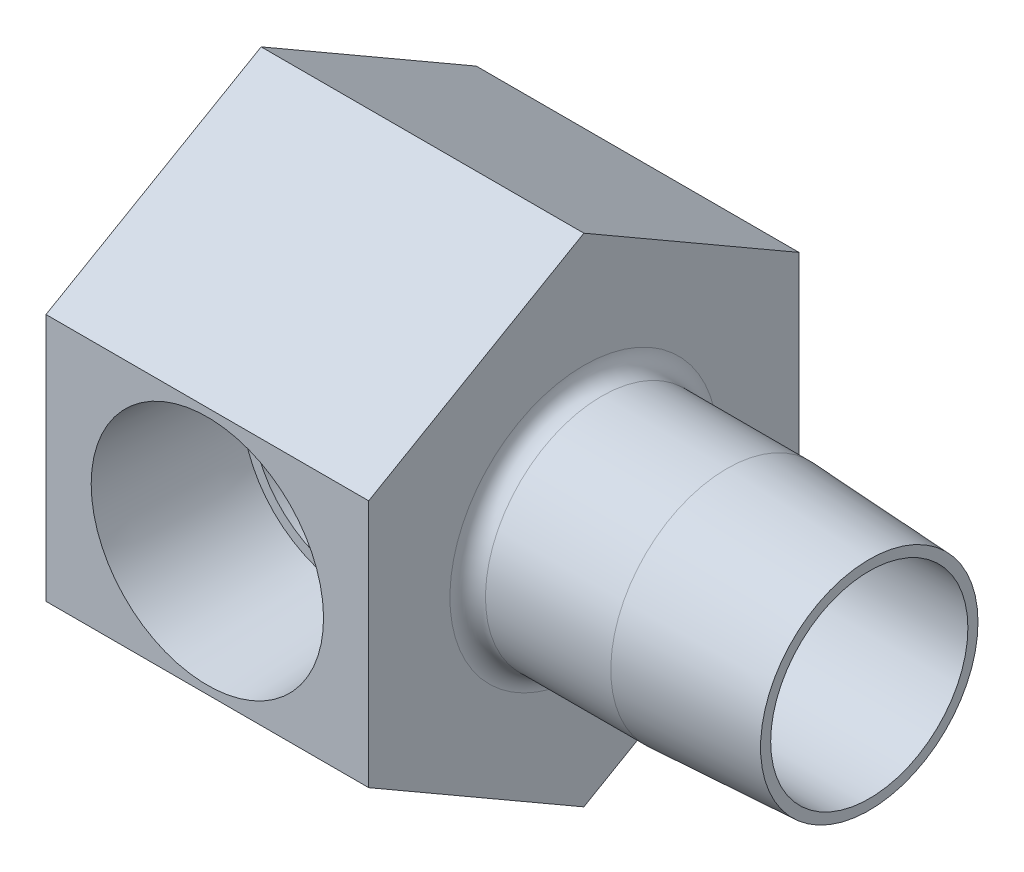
ISO-10303-21;
HEADER;
FILE_DESCRIPTION(('STEP AP214'),'2;1');
FILE_NAME('part.step','',(''),(''),'','','');
FILE_SCHEMA(('AUTOMOTIVE_DESIGN { 1 0 10303 214 1 1 1 1 }'));
ENDSEC;
DATA;
#1=APPLICATION_CONTEXT('core data for automotive mechanical design processes');
#2=APPLICATION_PROTOCOL_DEFINITION('international standard','automotive_design',2000,#1);
#3=PRODUCT_CONTEXT('',#1,'mechanical');
#4=PRODUCT('Part','Part','',(#3));
#5=PRODUCT_RELATED_PRODUCT_CATEGORY('part','',(#4));
#6=PRODUCT_DEFINITION_FORMATION('','',#4);
#7=PRODUCT_DEFINITION_CONTEXT('part definition',#1,'design');
#8=PRODUCT_DEFINITION('design','',#6,#7);
#9=PRODUCT_DEFINITION_SHAPE('','',#8);
#10=(LENGTH_UNIT() NAMED_UNIT(*) SI_UNIT(.MILLI.,.METRE.));
#11=(NAMED_UNIT(*) PLANE_ANGLE_UNIT() SI_UNIT($,.RADIAN.));
#12=(NAMED_UNIT(*) SI_UNIT($,.STERADIAN.) SOLID_ANGLE_UNIT());
#13=UNCERTAINTY_MEASURE_WITH_UNIT(LENGTH_MEASURE(1.E-05),#10,'distance_accuracy_value','');
#14=(GEOMETRIC_REPRESENTATION_CONTEXT(3) GLOBAL_UNCERTAINTY_ASSIGNED_CONTEXT((#13)) GLOBAL_UNIT_ASSIGNED_CONTEXT((#10,
#11,#12)) REPRESENTATION_CONTEXT('',''));
#15=CARTESIAN_POINT('',(0.,0.,0.));
#16=DIRECTION('',(0.,0.,1.));
#17=DIRECTION('',(1.,0.,0.));
#18=AXIS2_PLACEMENT_3D('',#15,#16,#17);
#19=CARTESIAN_POINT('',(6.30059133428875,0.,-4.81071060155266));
#20=DIRECTION('',(-1.,0.,0.));
#21=DIRECTION('',(0.,0.,1.));
#22=AXIS2_PLACEMENT_3D('',#19,#20,#21);
#23=PLANE('',#22);
#24=CARTESIAN_POINT('',(6.30059133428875,0.,0.));
#25=DIRECTION('',(-1.,0.,0.));
#26=DIRECTION('',(0.,0.,1.));
#27=AXIS2_PLACEMENT_3D('',#24,#25,#26);
#28=CIRCLE('',#27,4.365625);
#29=CARTESIAN_POINT('',(6.30059133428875,0.,4.365625));
#30=VERTEX_POINT('',#29);
#31=EDGE_CURVE('E17',#30,#30,#28,.F.);
#32=ORIENTED_EDGE('',*,*,#31,.F.);
#33=EDGE_LOOP('',(#32));
#34=FACE_BOUND('',#33,.T.);
#35=CARTESIAN_POINT('',(6.30059133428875,0.,0.));
#36=DIRECTION('',(1.,0.,0.));
#37=DIRECTION('',(0.,0.,-1.));
#38=AXIS2_PLACEMENT_3D('',#35,#36,#37);
#39=CIRCLE('',#38,4.8133);
#40=CARTESIAN_POINT('',(6.30059133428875,0.,-4.8133));
#41=VERTEX_POINT('',#40);
#42=EDGE_CURVE('E132',#41,#41,#39,.T.);
#43=ORIENTED_EDGE('',*,*,#42,.T.);
#44=EDGE_LOOP('',(#43));
#45=FACE_BOUND('',#44,.T.);
#46=ADVANCED_FACE('F14',(#34,#45),#23,.F.);
#47=CARTESIAN_POINT('',(47.3879923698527,0.,0.));
#48=DIRECTION('',(-1.,0.,0.));
#49=DIRECTION('',(0.,0.,1.));
#50=AXIS2_PLACEMENT_3D('',#47,#48,#49);
#51=CYLINDRICAL_SURFACE('',#50,5.1435);
#52=CARTESIAN_POINT('',(0.,0.,0.));
#53=DIRECTION('',(1.,0.,0.));
#54=DIRECTION('',(0.,0.,-1.));
#55=AXIS2_PLACEMENT_3D('',#52,#53,#54);
#56=CIRCLE('',#55,5.1435);
#57=CARTESIAN_POINT('',(0.,0.,-5.1435));
#58=VERTEX_POINT('',#57);
#59=EDGE_CURVE('E135',#58,#58,#56,.T.);
#60=ORIENTED_EDGE('',*,*,#59,.F.);
#61=EDGE_LOOP('',(#60));
#62=FACE_BOUND('',#61,.T.);
#63=CARTESIAN_POINT('',(-5.54850866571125,0.,0.));
#64=DIRECTION('',(1.,0.,0.));
#65=DIRECTION('',(0.,1.,0.));
#66=AXIS2_PLACEMENT_3D('',#63,#64,#65);
#67=CIRCLE('',#66,5.1435);
#68=CARTESIAN_POINT('',(-5.54850866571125,5.1435,0.));
#69=VERTEX_POINT('',#68);
#70=EDGE_CURVE('E9',#69,#69,#67,.T.);
#71=ORIENTED_EDGE('',*,*,#70,.T.);
#72=EDGE_LOOP('',(#71));
#73=FACE_BOUND('',#72,.T.);
#74=ADVANCED_FACE('F141',(#62,#73),#51,.T.);
#75=CARTESIAN_POINT('',(-13.4796586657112,0.,9.525));
#76=DIRECTION('',(0.,0.,1.));
#77=DIRECTION('',(1.,0.,0.));
#78=AXIS2_PLACEMENT_3D('',#75,#76,#77);
#79=CONICAL_SURFACE('',#78,5.1435,0.0523598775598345);
#80=CARTESIAN_POINT('',(-13.4796586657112,0.,9.525));
#81=DIRECTION('',(0.,0.,-1.));
#82=DIRECTION('',(-1.,0.,0.));
#83=AXIS2_PLACEMENT_3D('',#80,#81,#82);
#84=CIRCLE('',#83,5.1435);
#85=CARTESIAN_POINT('',(-18.6231586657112,0.,9.525));
#86=VERTEX_POINT('',#85);
#87=EDGE_CURVE('E464',#86,#86,#84,.T.);
#88=ORIENTED_EDGE('',*,*,#87,.F.);
#89=EDGE_LOOP('',(#88));
#90=FACE_BOUND('',#89,.T.);
#91=CARTESIAN_POINT('',(-13.4796586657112,0.,3.17500000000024));
#92=DIRECTION('',(0.,0.,-1.));
#93=DIRECTION('',(-1.,0.,0.));
#94=AXIS2_PLACEMENT_3D('',#91,#92,#93);
#95=CIRCLE('',#94,4.81071060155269);
#96=CARTESIAN_POINT('',(-9.7160327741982,-2.99634054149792,3.17500000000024));
#97=VERTEX_POINT('',#96);
#98=CARTESIAN_POINT('',(-9.7160327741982,2.99634054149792,3.17500000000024));
#99=VERTEX_POINT('',#98);
#100=EDGE_CURVE('E459',#97,#99,#95,.T.);
#101=ORIENTED_EDGE('',*,*,#100,.T.);
#102=CARTESIAN_POINT('',(-9.7162148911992,2.99655245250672,3.17480000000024));
#103=CARTESIAN_POINT('',(-9.65177316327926,2.92155827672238,3.24556398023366));
#104=CARTESIAN_POINT('',(-9.58883021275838,2.84341410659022,3.31431393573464));
#105=CARTESIAN_POINT('',(-9.46650127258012,2.68056902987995,3.44736758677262));
#106=CARTESIAN_POINT('',(-9.40712057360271,2.59585877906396,3.5116646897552));
#107=CARTESIAN_POINT('',(-9.23463551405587,2.33059710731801,3.69781411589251));
#108=CARTESIAN_POINT('',(-9.12811309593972,2.13996459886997,3.81191441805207));
#109=CARTESIAN_POINT('',(-8.95638480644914,1.76978922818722,3.99514671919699));
#110=CARTESIAN_POINT('',(-8.88720047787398,1.59429861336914,4.06866685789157));
#111=CARTESIAN_POINT('',(-8.79902482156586,1.32069459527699,4.16217936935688));
#112=CARTESIAN_POINT('',(-8.77225288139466,1.22786736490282,4.19053473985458));
#113=CARTESIAN_POINT('',(-8.72432097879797,1.0391950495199,4.24125952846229));
#114=CARTESIAN_POINT('',(-8.70315862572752,0.943351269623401,4.26363149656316));
#115=CARTESIAN_POINT('',(-8.6667096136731,0.748466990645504,4.30214215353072));
#116=CARTESIAN_POINT('',(-8.6514728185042,0.649406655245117,4.3182279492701));
#117=CARTESIAN_POINT('',(-8.62746138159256,0.449682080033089,4.34356923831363));
#118=CARTESIAN_POINT('',(-8.61868373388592,0.349018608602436,4.35282790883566));
#119=CARTESIAN_POINT('',(-8.6077795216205,0.146869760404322,4.36432881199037));
#120=CARTESIAN_POINT('',(-8.605656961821,0.0453839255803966,4.36656681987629));
#121=CARTESIAN_POINT('',(-8.60812463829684,-0.157407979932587,4.36396450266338));
#122=CARTESIAN_POINT('',(-8.61271429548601,-0.258714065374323,4.35912478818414));
#123=CARTESIAN_POINT('',(-8.62762208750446,-0.449057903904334,4.3433984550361));
#124=CARTESIAN_POINT('',(-8.63724926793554,-0.538211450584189,4.33324113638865));
#125=CARTESIAN_POINT('',(-8.66154466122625,-0.715062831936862,4.30759390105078));
#126=CARTESIAN_POINT('',(-8.67621453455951,-0.802760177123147,4.29210222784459));
#127=CARTESIAN_POINT('',(-8.72741978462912,-1.06271154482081,4.23799011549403));
#128=CARTESIAN_POINT('',(-8.77116897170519,-1.23204639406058,4.19171347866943));
#129=CARTESIAN_POINT('',(-8.87758623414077,-1.56656708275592,4.0788703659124));
#130=CARTESIAN_POINT('',(-8.94101646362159,-1.73122409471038,4.01148520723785));
#131=CARTESIAN_POINT('',(-9.08275153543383,-2.04618319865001,3.86035833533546));
#132=CARTESIAN_POINT('',(-9.16107690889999,-2.19646504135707,3.77659404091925));
#133=CARTESIAN_POINT('',(-9.31664062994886,-2.45998630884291,3.60939417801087));
#134=CARTESIAN_POINT('',(-9.39226045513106,-2.57539375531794,3.52781530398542));
#135=CARTESIAN_POINT('',(-9.54984469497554,-2.79452635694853,3.35685501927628));
#136=CARTESIAN_POINT('',(-9.63177855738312,-2.89830245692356,3.26751094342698));
#137=CARTESIAN_POINT('',(-9.7162148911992,-2.99655245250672,3.17480000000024));
#138=B_SPLINE_CURVE_WITH_KNOTS('',3,(#102,#103,#104,#105,#106,#107,#108,#109,#110,#111,#112,
#113,#114,#115,#116,#117,#118,#119,#120,#121,#122,#123,#124,#125,#126,#127,#128,#129,#130,#131,
#132,#133,#134,#135,#136,#137),.UNSPECIFIED.,.F.,.F.,(4,2,2,2,2,2,2,2,2,2,2,2,2,2,2,2,2,4),(0.,
0.364634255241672,0.729797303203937,1.46525067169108,2.06997219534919,2.37170467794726,
2.67330836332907,2.97739780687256,3.28134564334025,3.58547634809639,3.88958081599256,
4.15999530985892,4.43049893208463,4.97084503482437,5.53548493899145,6.10090884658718,
6.58103480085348,7.05896806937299),.UNSPECIFIED.);
#139=EDGE_CURVE('E121',#99,#97,#138,.T.);
#140=ORIENTED_EDGE('',*,*,#139,.T.);
#141=EDGE_LOOP('',(#101,#140));
#142=FACE_BOUND('',#141,.T.);
#143=ADVANCED_FACE('F144',(#90,#142),#79,.F.);
#144=CARTESIAN_POINT('',(-8.66894806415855,0.,3.17500000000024));
#145=DIRECTION('',(0.,0.,1.));
#146=DIRECTION('',(1.,0.,0.));
#147=AXIS2_PLACEMENT_3D('',#144,#145,#146);
#148=PLANE('',#147);
#149=ORIENTED_EDGE('',*,*,#100,.F.);
#150=DIRECTION('',(1.,0.,0.));
#151=VECTOR('',#150,1.);
#152=CARTESIAN_POINT('',(45.5141000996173,-2.99634054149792,3.17500000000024));
#153=LINE('',#152,#151);
#154=CARTESIAN_POINT('',(-10.3046586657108,-2.99634054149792,3.17500000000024));
#155=VERTEX_POINT('',#154);
#156=EDGE_CURVE('E118',#97,#155,#153,.F.);
#157=ORIENTED_EDGE('',*,*,#156,.T.);
#158=CARTESIAN_POINT('',(-13.4796586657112,0.,3.17500000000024));
#159=DIRECTION('',(0.,0.,-1.));
#160=DIRECTION('',(-1.,0.,0.));
#161=AXIS2_PLACEMENT_3D('',#158,#159,#160);
#162=CIRCLE('',#161,4.36562500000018);
#163=CARTESIAN_POINT('',(-10.3046586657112,2.99634054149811,3.17500000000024));
#164=VERTEX_POINT('',#163);
#165=EDGE_CURVE('E117',#155,#164,#162,.T.);
#166=ORIENTED_EDGE('',*,*,#165,.T.);
#167=DIRECTION('',(1.,0.,0.));
#168=VECTOR('',#167,1.);
#169=CARTESIAN_POINT('',(45.5141000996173,2.99634054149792,3.17500000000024));
#170=LINE('',#169,#168);
#171=EDGE_CURVE('E124',#164,#99,#170,.T.);
#172=ORIENTED_EDGE('',*,*,#171,.T.);
#173=EDGE_LOOP('',(#149,#157,#166,#172));
#174=FACE_BOUND('',#173,.T.);
#175=ADVANCED_FACE('F191',(#174),#148,.T.);
#176=CARTESIAN_POINT('',(-13.4796586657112,0.,26.3809426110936));
#177=DIRECTION('',(0.,0.,-1.));
#178=DIRECTION('',(-1.,0.,0.));
#179=AXIS2_PLACEMENT_3D('',#176,#177,#178);
#180=CYLINDRICAL_SURFACE('',#179,4.36562500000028);
#181=ORIENTED_EDGE('',*,*,#165,.F.);
#182=CARTESIAN_POINT('',(-13.4796586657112,0.,0.));
#183=DIRECTION('',(0.707106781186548,0.,-0.707106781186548));
#184=DIRECTION('',(-0.707106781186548,0.,-0.707106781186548));
#185=AXIS2_PLACEMENT_3D('',#182,#183,#184);
#186=ELLIPSE('',#185,6.17392608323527,4.36562500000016);
#187=CARTESIAN_POINT('',(-13.4796586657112,-4.3656250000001,0.));
#188=VERTEX_POINT('',#187);
#189=EDGE_CURVE('E103',#155,#188,#186,.T.);
#190=ORIENTED_EDGE('',*,*,#189,.T.);
#191=CARTESIAN_POINT('',(-13.4796586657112,0.,0.));
#192=DIRECTION('',(-0.707106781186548,0.,-0.707106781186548));
#193=DIRECTION('',(0.707106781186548,0.,-0.707106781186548));
#194=AXIS2_PLACEMENT_3D('',#191,#192,#193);
#195=ELLIPSE('',#194,6.17392608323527,4.36562500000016);
#196=CARTESIAN_POINT('',(-11.6345284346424,-3.95653586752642,-1.84513023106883));
#197=VERTEX_POINT('',#196);
#198=EDGE_CURVE('E99',#188,#197,#195,.F.);
#199=ORIENTED_EDGE('',*,*,#198,.T.);
#200=CARTESIAN_POINT('',(-13.4796586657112,0.,-1.84513023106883));
#201=DIRECTION('',(0.,0.,-1.));
#202=DIRECTION('',(-1.,0.,0.));
#203=AXIS2_PLACEMENT_3D('',#200,#201,#202);
#204=CIRCLE('',#203,4.36562500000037);
#205=CARTESIAN_POINT('',(-11.6345284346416,3.95653586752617,-1.84513023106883));
#206=VERTEX_POINT('',#205);
#207=EDGE_CURVE('E111',#197,#206,#204,.T.);
#208=ORIENTED_EDGE('',*,*,#207,.T.);
#209=CARTESIAN_POINT('',(-13.4796586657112,4.3656250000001,0.));
#210=VERTEX_POINT('',#209);
#211=EDGE_CURVE('E29',#206,#210,#195,.F.);
#212=ORIENTED_EDGE('',*,*,#211,.T.);
#213=EDGE_CURVE('E120',#210,#164,#186,.T.);
#214=ORIENTED_EDGE('',*,*,#213,.T.);
#215=EDGE_LOOP('',(#181,#190,#199,#208,#212,#214));
#216=FACE_BOUND('',#215,.T.);
#217=ADVANCED_FACE('F114',(#216),#180,.F.);
#218=CARTESIAN_POINT('',(-13.4796586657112,0.,-1.84513023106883));
#219=DIRECTION('',(0.,0.,1.));
#220=DIRECTION('',(1.,0.,0.));
#221=AXIS2_PLACEMENT_3D('',#218,#219,#220);
#222=CONICAL_SURFACE('',#221,4.36562500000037,1.0471975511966);
#223=ORIENTED_EDGE('',*,*,#207,.F.);
#224=CARTESIAN_POINT('',(-11.633908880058,-3.95662913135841,-1.84493023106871));
#225=CARTESIAN_POINT('',(-11.7084330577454,-3.94541760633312,-1.8689810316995));
#226=CARTESIAN_POINT('',(-11.7832061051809,-3.93428272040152,-1.89228060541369));
#227=CARTESIAN_POINT('',(-11.9333902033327,-3.91242782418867,-1.93706139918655));
#228=CARTESIAN_POINT('',(-12.0088015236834,-3.90170800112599,-1.95854180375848));
#229=CARTESIAN_POINT('',(-12.234923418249,-3.87074056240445,-2.01943082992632));
#230=CARTESIAN_POINT('',(-12.3866798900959,-3.8515020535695,-2.05567192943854));
#231=CARTESIAN_POINT('',(-12.6167297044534,-3.82676825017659,-2.10115040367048));
#232=CARTESIAN_POINT('',(-12.6939224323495,-3.81920348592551,-2.11484194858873));
#233=CARTESIAN_POINT('',(-12.8489890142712,-3.80585437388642,-2.13877054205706));
#234=CARTESIAN_POINT('',(-12.9268627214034,-3.80006965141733,-2.14900831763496));
#235=CARTESIAN_POINT('',(-13.0837297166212,-3.79060206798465,-2.16566774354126));
#236=CARTESIAN_POINT('',(-13.1627270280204,-3.78693482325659,-2.17206105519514));
#237=CARTESIAN_POINT('',(-13.3210956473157,-3.7819879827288,-2.18065465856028));
#238=CARTESIAN_POINT('',(-13.4004672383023,-3.7807106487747,-2.18285097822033));
#239=CARTESIAN_POINT('',(-13.4798586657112,-3.78074215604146,-2.18281249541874));
#240=B_SPLINE_CURVE_WITH_KNOTS('',3,(#224,#225,#226,#227,#228,#229,#230,#231,#232,#233,#234,
#235,#236,#237,#238,#239),.UNSPECIFIED.,.F.,.F.,(4,2,2,2,2,2,2,4),(0.,0.237303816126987,
0.474713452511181,0.945835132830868,1.18204117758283,1.41819746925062,1.65607385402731,
1.89417525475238),.UNSPECIFIED.);
#241=CARTESIAN_POINT('',(-13.4796586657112,-3.78074215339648,-2.18281249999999));
#242=VERTEX_POINT('',#241);
#243=EDGE_CURVE('E107',#197,#242,#240,.T.);
#244=ORIENTED_EDGE('',*,*,#243,.T.);
#245=DIRECTION('',(0.,0.866025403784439,-0.5));
#246=VECTOR('',#245,1.);
#247=CARTESIAN_POINT('',(-13.4796586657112,0.,-4.365625));
#248=LINE('',#247,#246);
#249=CARTESIAN_POINT('',(-13.4796586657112,0.,-4.365625));
#250=VERTEX_POINT('',#249);
#251=EDGE_CURVE('E156',#242,#250,#248,.T.);
#252=ORIENTED_EDGE('',*,*,#251,.T.);
#253=DIRECTION('',(0.,0.866025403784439,0.5));
#254=VECTOR('',#253,1.);
#255=CARTESIAN_POINT('',(-13.4796586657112,0.,-4.365625));
#256=LINE('',#255,#254);
#257=CARTESIAN_POINT('',(-13.4796586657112,3.78074215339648,-2.18281249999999));
#258=VERTEX_POINT('',#257);
#259=EDGE_CURVE('E513',#250,#258,#256,.T.);
#260=ORIENTED_EDGE('',*,*,#259,.T.);
#261=CARTESIAN_POINT('',(-13.4798586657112,3.78074215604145,-2.18281249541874));
#262=CARTESIAN_POINT('',(-13.4182556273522,3.78073202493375,-2.18282548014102));
#263=CARTESIAN_POINT('',(-13.3566617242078,3.78149280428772,-2.18151304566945));
#264=CARTESIAN_POINT('',(-13.2336463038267,3.78448017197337,-2.17632810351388));
#265=CARTESIAN_POINT('',(-13.1722247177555,3.78670605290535,-2.1724568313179));
#266=CARTESIAN_POINT('',(-12.9887432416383,3.79545033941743,-2.15717072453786));
#267=CARTESIAN_POINT('',(-12.8670802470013,3.80403629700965,-2.14208250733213));
#268=CARTESIAN_POINT('',(-12.5068152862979,3.83592256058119,-2.08475264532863));
#269=CARTESIAN_POINT('',(-12.2707455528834,3.8653919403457,-2.03039715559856));
#270=CARTESIAN_POINT('',(-11.9703724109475,3.90716169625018,-1.94762083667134));
#271=CARTESIAN_POINT('',(-11.9028624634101,3.91683509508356,-1.92810693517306));
#272=CARTESIAN_POINT('',(-11.7681429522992,3.93652410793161,-1.88758117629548));
#273=CARTESIAN_POINT('',(-11.7009346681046,3.94654056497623,-1.86656546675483));
#274=CARTESIAN_POINT('',(-11.633908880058,3.9566291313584,-1.84493023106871));
#275=B_SPLINE_CURVE_WITH_KNOTS('',3,(#261,#262,#263,#264,#265,#266,#267,#268,#269,#270,#271,
#272,#273,#274),.UNSPECIFIED.,.F.,.F.,(4,2,2,2,2,2,4),(0.,0.184774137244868,0.369459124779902,
0.737674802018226,1.4676102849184,1.68043381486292,1.89382432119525),.UNSPECIFIED.);
#276=EDGE_CURVE('E177',#258,#206,#275,.T.);
#277=ORIENTED_EDGE('',*,*,#276,.T.);
#278=EDGE_LOOP('',(#223,#244,#252,#260,#277));
#279=FACE_BOUND('',#278,.T.);
#280=ADVANCED_FACE('F165',(#279),#222,.F.);
#281=CARTESIAN_POINT('',(-6.33590866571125,5.4992613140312,9.525));
#282=DIRECTION('',(0.,0.,-1.));
#283=DIRECTION('',(-1.,0.,0.));
#284=AXIS2_PLACEMENT_3D('',#281,#282,#283);
#285=PLANE('',#284);
#286=DIRECTION('',(0.,-1.,0.));
#287=VECTOR('',#286,1.);
#288=CARTESIAN_POINT('',(-20.6234086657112,5.4992613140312,9.525));
#289=LINE('',#288,#287);
#290=CARTESIAN_POINT('',(-20.6234086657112,5.4992613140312,9.525));
#291=VERTEX_POINT('',#290);
#292=CARTESIAN_POINT('',(-20.6234086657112,-5.49926131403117,9.525));
#293=VERTEX_POINT('',#292);
#294=EDGE_CURVE('E477',#291,#293,#289,.T.);
#295=ORIENTED_EDGE('',*,*,#294,.T.);
#296=DIRECTION('',(-1.,0.,0.));
#297=VECTOR('',#296,1.);
#298=CARTESIAN_POINT('',(-6.33590866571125,-5.49926131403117,9.525));
#299=LINE('',#298,#297);
#300=CARTESIAN_POINT('',(-6.33590866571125,-5.49926131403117,9.525));
#301=VERTEX_POINT('',#300);
#302=EDGE_CURVE('E499',#301,#293,#299,.T.);
#303=ORIENTED_EDGE('',*,*,#302,.F.);
#304=DIRECTION('',(0.,-1.,0.));
#305=VECTOR('',#304,1.);
#306=CARTESIAN_POINT('',(-6.33590866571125,5.4992613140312,9.525));
#307=LINE('',#306,#305);
#308=CARTESIAN_POINT('',(-6.33590866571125,5.4992613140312,9.525));
#309=VERTEX_POINT('',#308);
#310=EDGE_CURVE('E492',#309,#301,#307,.T.);
#311=ORIENTED_EDGE('',*,*,#310,.F.);
#312=DIRECTION('',(-1.,0.,0.));
#313=VECTOR('',#312,1.);
#314=CARTESIAN_POINT('',(-6.33590866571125,5.4992613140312,9.525));
#315=LINE('',#314,#313);
#316=EDGE_CURVE('E502',#309,#291,#315,.T.);
#317=ORIENTED_EDGE('',*,*,#316,.T.);
#318=EDGE_LOOP('',(#295,#303,#311,#317));
#319=FACE_BOUND('',#318,.T.);
#320=ORIENTED_EDGE('',*,*,#87,.T.);
#321=EDGE_LOOP('',(#320));
#322=FACE_BOUND('',#321,.T.);
#323=ADVANCED_FACE('F204',(#319,#322),#285,.F.);
#324=CARTESIAN_POINT('',(-6.33590866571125,-5.49926131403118,-9.525));
#325=DIRECTION('',(1.,0.,0.));
#326=DIRECTION('',(0.,1.,0.));
#327=AXIS2_PLACEMENT_3D('',#324,#325,#326);
#328=PLANE('',#327);
#329=CARTESIAN_POINT('',(-6.33590866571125,0.,0.));
#330=DIRECTION('',(1.,0.,0.));
#331=DIRECTION('',(0.,1.,0.));
#332=AXIS2_PLACEMENT_3D('',#329,#330,#331);
#333=CIRCLE('',#332,5.9309);
#334=CARTESIAN_POINT('',(-6.33590866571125,5.9309,0.));
#335=VERTEX_POINT('',#334);
#336=EDGE_CURVE('E22',#335,#335,#333,.F.);
#337=ORIENTED_EDGE('',*,*,#336,.T.);
#338=EDGE_LOOP('',(#337));
#339=FACE_BOUND('',#338,.T.);
#340=DIRECTION('',(0.,0.5,-0.866025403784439));
#341=VECTOR('',#340,1.);
#342=CARTESIAN_POINT('',(-6.33590866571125,-10.9985226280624,0.));
#343=LINE('',#342,#341);
#344=CARTESIAN_POINT('',(-6.33590866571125,-10.9985226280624,0.));
#345=VERTEX_POINT('',#344);
#346=CARTESIAN_POINT('',(-6.33590866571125,-5.49926131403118,-9.525));
#347=VERTEX_POINT('',#346);
#348=EDGE_CURVE('E483',#345,#347,#343,.T.);
#349=ORIENTED_EDGE('',*,*,#348,.T.);
#350=DIRECTION('',(0.,1.,0.));
#351=VECTOR('',#350,1.);
#352=CARTESIAN_POINT('',(-6.33590866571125,-5.49926131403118,-9.525));
#353=LINE('',#352,#351);
#354=CARTESIAN_POINT('',(-6.33590866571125,5.49926131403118,-9.525));
#355=VERTEX_POINT('',#354);
#356=EDGE_CURVE('E486',#347,#355,#353,.T.);
#357=ORIENTED_EDGE('',*,*,#356,.T.);
#358=DIRECTION('',(0.,0.5,0.866025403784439));
#359=VECTOR('',#358,1.);
#360=CARTESIAN_POINT('',(-6.33590866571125,5.49926131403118,-9.525));
#361=LINE('',#360,#359);
#362=CARTESIAN_POINT('',(-6.33590866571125,10.9985226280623,0.));
#363=VERTEX_POINT('',#362);
#364=EDGE_CURVE('E488',#355,#363,#361,.T.);
#365=ORIENTED_EDGE('',*,*,#364,.T.);
#366=DIRECTION('',(0.,-0.5,0.86602540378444));
#367=VECTOR('',#366,1.);
#368=CARTESIAN_POINT('',(-6.33590866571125,10.9985226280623,0.));
#369=LINE('',#368,#367);
#370=EDGE_CURVE('E490',#363,#309,#369,.T.);
#371=ORIENTED_EDGE('',*,*,#370,.T.);
#372=ORIENTED_EDGE('',*,*,#310,.T.);
#373=DIRECTION('',(0.,-0.5,-0.866025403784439));
#374=VECTOR('',#373,1.);
#375=CARTESIAN_POINT('',(-6.33590866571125,-5.49926131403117,9.525));
#376=LINE('',#375,#374);
#377=EDGE_CURVE('E37',#301,#345,#376,.T.);
#378=ORIENTED_EDGE('',*,*,#377,.T.);
#379=EDGE_LOOP('',(#349,#357,#365,#371,#372,#378));
#380=FACE_BOUND('',#379,.T.);
#381=ADVANCED_FACE('F200',(#339,#380),#328,.T.);
#382=CARTESIAN_POINT('',(-6.33590866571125,-10.9985226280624,0.));
#383=DIRECTION('',(0.,0.866025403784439,0.5));
#384=DIRECTION('',(0.,-0.5,0.866025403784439));
#385=AXIS2_PLACEMENT_3D('',#382,#383,#384);
#386=PLANE('',#385);
#387=DIRECTION('',(0.,0.5,-0.866025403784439));
#388=VECTOR('',#387,1.);
#389=CARTESIAN_POINT('',(-20.6234086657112,-10.9985226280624,0.));
#390=LINE('',#389,#388);
#391=CARTESIAN_POINT('',(-20.6234086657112,-10.9985226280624,0.));
#392=VERTEX_POINT('',#391);
#393=CARTESIAN_POINT('',(-20.6234086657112,-5.49926131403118,-9.525));
#394=VERTEX_POINT('',#393);
#395=EDGE_CURVE('E467',#392,#394,#390,.T.);
#396=ORIENTED_EDGE('',*,*,#395,.T.);
#397=DIRECTION('',(-1.,0.,0.));
#398=VECTOR('',#397,1.);
#399=CARTESIAN_POINT('',(-6.33590866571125,-5.49926131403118,-9.525));
#400=LINE('',#399,#398);
#401=EDGE_CURVE('E510',#347,#394,#400,.T.);
#402=ORIENTED_EDGE('',*,*,#401,.F.);
#403=ORIENTED_EDGE('',*,*,#348,.F.);
#404=DIRECTION('',(-1.,0.,0.));
#405=VECTOR('',#404,1.);
#406=CARTESIAN_POINT('',(-6.33590866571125,-10.9985226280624,0.));
#407=LINE('',#406,#405);
#408=EDGE_CURVE('E495',#345,#392,#407,.T.);
#409=ORIENTED_EDGE('',*,*,#408,.T.);
#410=EDGE_LOOP('',(#396,#402,#403,#409));
#411=FACE_BOUND('',#410,.T.);
#412=ADVANCED_FACE('F203',(#411),#386,.F.);
#413=CARTESIAN_POINT('',(-6.33590866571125,-5.49926131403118,-9.525));
#414=DIRECTION('',(0.,0.,1.));
#415=DIRECTION('',(0.,-1.,0.));
#416=AXIS2_PLACEMENT_3D('',#413,#414,#415);
#417=PLANE('',#416);
#418=DIRECTION('',(0.,1.,0.));
#419=VECTOR('',#418,1.);
#420=CARTESIAN_POINT('',(-20.6234086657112,-5.49926131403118,-9.525));
#421=LINE('',#420,#419);
#422=CARTESIAN_POINT('',(-20.6234086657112,5.49926131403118,-9.525));
#423=VERTEX_POINT('',#422);
#424=EDGE_CURVE('E468',#394,#423,#421,.T.);
#425=ORIENTED_EDGE('',*,*,#424,.T.);
#426=DIRECTION('',(-1.,0.,0.));
#427=VECTOR('',#426,1.);
#428=CARTESIAN_POINT('',(-6.33590866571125,5.49926131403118,-9.525));
#429=LINE('',#428,#427);
#430=EDGE_CURVE('E508',#355,#423,#429,.T.);
#431=ORIENTED_EDGE('',*,*,#430,.F.);
#432=ORIENTED_EDGE('',*,*,#356,.F.);
#433=ORIENTED_EDGE('',*,*,#401,.T.);
#434=EDGE_LOOP('',(#425,#431,#432,#433));
#435=FACE_BOUND('',#434,.T.);
#436=ADVANCED_FACE('F218',(#435),#417,.F.);
#437=CARTESIAN_POINT('',(-6.33590866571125,5.49926131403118,-9.525));
#438=DIRECTION('',(0.,-0.866025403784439,0.5));
#439=DIRECTION('',(0.,-0.5,-0.866025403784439));
#440=AXIS2_PLACEMENT_3D('',#437,#438,#439);
#441=PLANE('',#440);
#442=DIRECTION('',(0.,0.5,0.866025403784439));
#443=VECTOR('',#442,1.);
#444=CARTESIAN_POINT('',(-20.6234086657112,5.49926131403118,-9.525));
#445=LINE('',#444,#443);
#446=CARTESIAN_POINT('',(-20.6234086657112,10.9985226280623,0.));
#447=VERTEX_POINT('',#446);
#448=EDGE_CURVE('E471',#423,#447,#445,.T.);
#449=ORIENTED_EDGE('',*,*,#448,.T.);
#450=DIRECTION('',(-1.,0.,0.));
#451=VECTOR('',#450,1.);
#452=CARTESIAN_POINT('',(-6.33590866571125,10.9985226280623,0.));
#453=LINE('',#452,#451);
#454=EDGE_CURVE('E505',#363,#447,#453,.T.);
#455=ORIENTED_EDGE('',*,*,#454,.F.);
#456=ORIENTED_EDGE('',*,*,#364,.F.);
#457=ORIENTED_EDGE('',*,*,#430,.T.);
#458=EDGE_LOOP('',(#449,#455,#456,#457));
#459=FACE_BOUND('',#458,.T.);
#460=ADVANCED_FACE('F214',(#459),#441,.F.);
#461=CARTESIAN_POINT('',(-6.33590866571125,10.9985226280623,0.));
#462=DIRECTION('',(0.,-0.86602540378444,-0.5));
#463=DIRECTION('',(0.,0.5,-0.86602540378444));
#464=AXIS2_PLACEMENT_3D('',#461,#462,#463);
#465=PLANE('',#464);
#466=DIRECTION('',(0.,-0.5,0.86602540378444));
#467=VECTOR('',#466,1.);
#468=CARTESIAN_POINT('',(-20.6234086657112,10.9985226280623,0.));
#469=LINE('',#468,#467);
#470=EDGE_CURVE('E474',#447,#291,#469,.T.);
#471=ORIENTED_EDGE('',*,*,#470,.T.);
#472=ORIENTED_EDGE('',*,*,#316,.F.);
#473=ORIENTED_EDGE('',*,*,#370,.F.);
#474=ORIENTED_EDGE('',*,*,#454,.T.);
#475=EDGE_LOOP('',(#471,#472,#473,#474));
#476=FACE_BOUND('',#475,.T.);
#477=ADVANCED_FACE('F207',(#476),#465,.F.);
#478=CARTESIAN_POINT('',(-6.33590866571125,-5.49926131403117,9.525));
#479=DIRECTION('',(0.,0.866025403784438,-0.5));
#480=DIRECTION('',(0.,0.5,0.866025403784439));
#481=AXIS2_PLACEMENT_3D('',#478,#479,#480);
#482=PLANE('',#481);
#483=DIRECTION('',(0.,-0.5,-0.866025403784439));
#484=VECTOR('',#483,1.);
#485=CARTESIAN_POINT('',(-20.6234086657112,-5.49926131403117,9.525));
#486=LINE('',#485,#484);
#487=EDGE_CURVE('E480',#293,#392,#486,.T.);
#488=ORIENTED_EDGE('',*,*,#487,.T.);
#489=ORIENTED_EDGE('',*,*,#408,.F.);
#490=ORIENTED_EDGE('',*,*,#377,.F.);
#491=ORIENTED_EDGE('',*,*,#302,.T.);
#492=EDGE_LOOP('',(#488,#489,#490,#491));
#493=FACE_BOUND('',#492,.T.);
#494=ADVANCED_FACE('F198',(#493),#482,.F.);
#495=CARTESIAN_POINT('',(-20.6234086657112,-5.49926131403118,-9.525));
#496=DIRECTION('',(1.,0.,0.));
#497=DIRECTION('',(0.,1.,0.));
#498=AXIS2_PLACEMENT_3D('',#495,#496,#497);
#499=PLANE('',#498);
#500=ORIENTED_EDGE('',*,*,#395,.F.);
#501=ORIENTED_EDGE('',*,*,#487,.F.);
#502=ORIENTED_EDGE('',*,*,#294,.F.);
#503=ORIENTED_EDGE('',*,*,#470,.F.);
#504=ORIENTED_EDGE('',*,*,#448,.F.);
#505=ORIENTED_EDGE('',*,*,#424,.F.);
#506=EDGE_LOOP('',(#500,#501,#502,#503,#504,#505));
#507=FACE_BOUND('',#506,.T.);
#508=ADVANCED_FACE('F194',(#507),#499,.F.);
#509=CARTESIAN_POINT('',(-13.4796586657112,0.,0.));
#510=DIRECTION('',(1.,0.,0.));
#511=DIRECTION('',(0.,0.,-1.));
#512=AXIS2_PLACEMENT_3D('',#509,#510,#511);
#513=PLANE('',#512);
#514=CARTESIAN_POINT('',(-13.4796586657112,0.,0.));
#515=DIRECTION('',(1.,0.,0.));
#516=DIRECTION('',(0.,0.,-1.));
#517=AXIS2_PLACEMENT_3D('',#514,#515,#516);
#518=CIRCLE('',#517,4.365625);
#519=EDGE_CURVE('E128',#250,#258,#518,.T.);
#520=ORIENTED_EDGE('',*,*,#519,.T.);
#521=ORIENTED_EDGE('',*,*,#259,.F.);
#522=EDGE_LOOP('',(#520,#521));
#523=FACE_BOUND('',#522,.T.);
#524=ADVANCED_FACE('F197',(#523),#513,.T.);
#525=EDGE_CURVE('E126',#242,#250,#518,.T.);
#526=ORIENTED_EDGE('',*,*,#525,.T.);
#527=ORIENTED_EDGE('',*,*,#251,.F.);
#528=EDGE_LOOP('',(#526,#527));
#529=FACE_BOUND('',#528,.T.);
#530=ADVANCED_FACE('F171',(#529),#513,.T.);
#531=CARTESIAN_POINT('',(45.5141000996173,0.,0.));
#532=DIRECTION('',(1.,0.,0.));
#533=DIRECTION('',(0.,0.,-1.));
#534=AXIS2_PLACEMENT_3D('',#531,#532,#533);
#535=CYLINDRICAL_SURFACE('',#534,4.365625);
#536=ORIENTED_EDGE('',*,*,#31,.T.);
#537=EDGE_LOOP('',(#536));
#538=FACE_BOUND('',#537,.T.);
#539=ORIENTED_EDGE('',*,*,#198,.F.);
#540=ORIENTED_EDGE('',*,*,#189,.F.);
#541=ORIENTED_EDGE('',*,*,#156,.F.);
#542=ORIENTED_EDGE('',*,*,#139,.F.);
#543=ORIENTED_EDGE('',*,*,#171,.F.);
#544=ORIENTED_EDGE('',*,*,#213,.F.);
#545=ORIENTED_EDGE('',*,*,#211,.F.);
#546=ORIENTED_EDGE('',*,*,#276,.F.);
#547=ORIENTED_EDGE('',*,*,#519,.F.);
#548=ORIENTED_EDGE('',*,*,#525,.F.);
#549=ORIENTED_EDGE('',*,*,#243,.F.);
#550=EDGE_LOOP('',(#539,#540,#541,#542,#543,#544,#545,#546,#547,#548,#549));
#551=FACE_BOUND('',#550,.T.);
#552=ADVANCED_FACE('F101',(#538,#551),#535,.F.);
#553=CARTESIAN_POINT('',(-5.54850866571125,0.,0.));
#554=DIRECTION('',(1.,0.,0.));
#555=DIRECTION('',(0.,1.,0.));
#556=AXIS2_PLACEMENT_3D('',#553,#554,#555);
#557=TOROIDAL_SURFACE('',#556,5.9309,0.7874);
#558=ORIENTED_EDGE('',*,*,#70,.F.);
#559=EDGE_LOOP('',(#558));
#560=FACE_BOUND('',#559,.T.);
#561=ORIENTED_EDGE('',*,*,#336,.F.);
#562=EDGE_LOOP('',(#561));
#563=FACE_BOUND('',#562,.T.);
#564=ADVANCED_FACE('F148',(#560,#563),#557,.F.);
#565=CARTESIAN_POINT('',(0.,0.,0.));
#566=DIRECTION('',(-1.,0.,0.));
#567=DIRECTION('',(0.,0.,1.));
#568=AXIS2_PLACEMENT_3D('',#565,#566,#567);
#569=CONICAL_SURFACE('',#568,5.1435,0.0523598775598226);
#570=ORIENTED_EDGE('',*,*,#42,.F.);
#571=EDGE_LOOP('',(#570));
#572=FACE_BOUND('',#571,.T.);
#573=ORIENTED_EDGE('',*,*,#59,.T.);
#574=EDGE_LOOP('',(#573));
#575=FACE_BOUND('',#574,.T.);
#576=ADVANCED_FACE('F139',(#572,#575),#569,.T.);
#577=CLOSED_SHELL('',(#46,#74,#143,#175,#217,#280,#323,#381,#412,#436,#460,#477,#494,#508,#524,
#530,#552,#564,#576));
#578=MANIFOLD_SOLID_BREP('B1',#577);
#579=ADVANCED_BREP_SHAPE_REPRESENTATION('',(#18,#578),#14);
#580=SHAPE_DEFINITION_REPRESENTATION(#9,#579);
ENDSEC;
END-ISO-10303-21;
